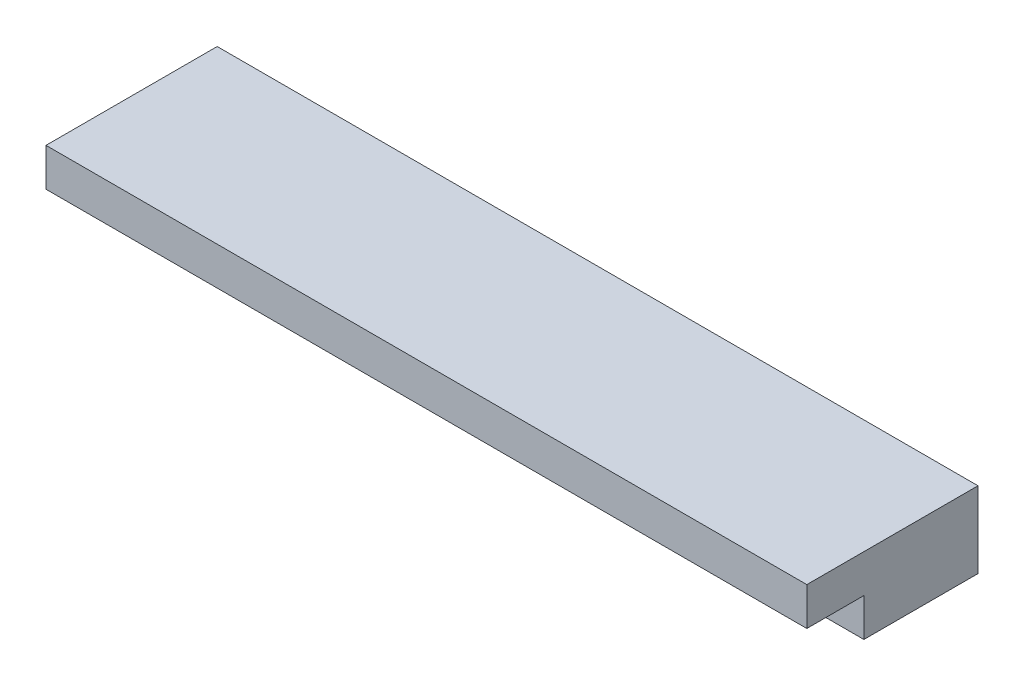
from build123d import *

# Parameters (mm, degrees)
EXTRUDE_1_DEPTH = 20


with BuildPart() as part:
    # Sketch 1 → Extrude 1 (new, symmetric)
    with BuildSketch(Plane(origin=(0, 0, 0), x_dir=(0, 0, -1), z_dir=(1, 0, 0))):
        Polygon((0, 0), (0, 2), (-3, 2), (-3, 4), (6, 4), (6, 0), align=None)
    extrude(amount=EXTRUDE_1_DEPTH, both=True)


solid = part.part
